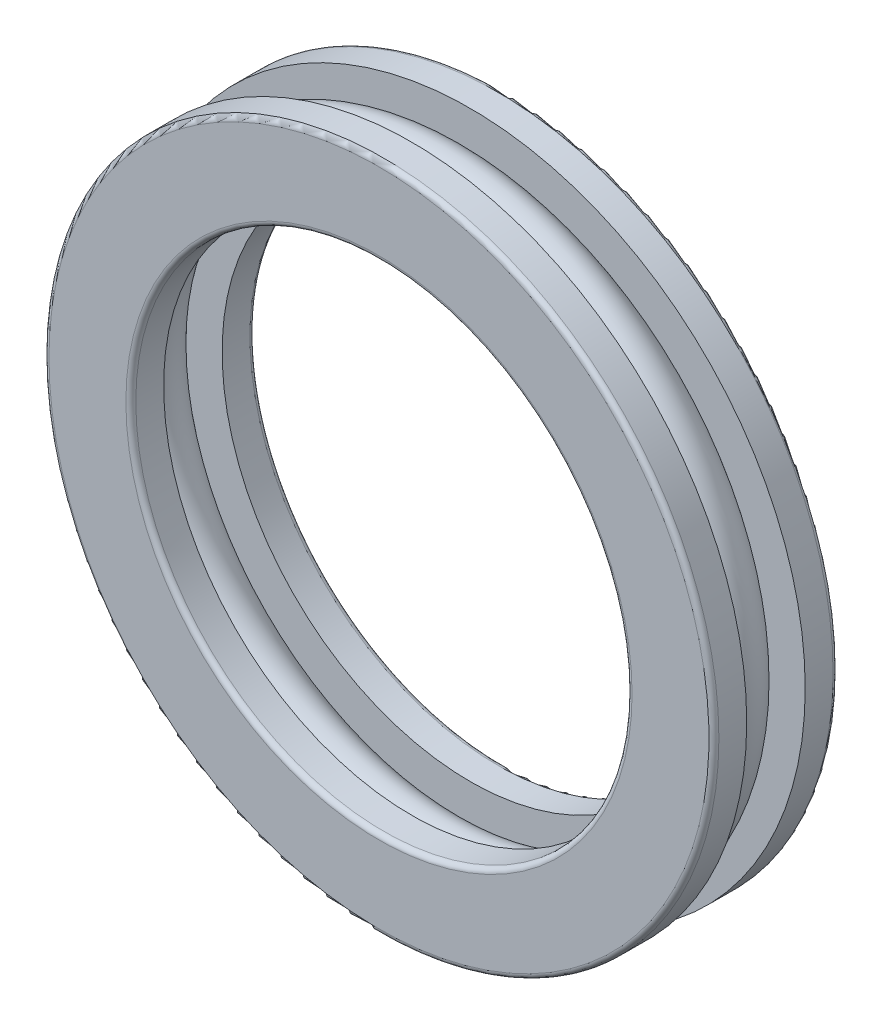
from build123d import *

# Parameters (mm, degrees)
SKETCH_1_R = 5.202601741
SKETCH_1_W = 17.5
SKETCH_1_H = 6.606566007
FILLET_1_R = 1
FILLET_2_R = 1


with BuildPart() as part:
    # Sketch 1 → Revolve 1 (revolve)
    with BuildSketch(Plane(origin=(0, 0, 0), x_dir=(1, 0, 0), z_dir=(0, 1, 0)), mode=Mode.PRIVATE) as revolve_1_sk:
        with Locations((-58.75, 12.5)):
            Circle(SKETCH_1_R)
        with Locations((-58.75, 3.303283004)):
            Rectangle(SKETCH_1_W, SKETCH_1_H)
        with Locations((-58.75, 21.696716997)):
            Rectangle(SKETCH_1_W, SKETCH_1_H)
    revolve(revolve_1_sk.sketch.rotate(Axis((0, 0, 0), (0, 0, -1)), 180), axis=Axis((0, 0, 0), (0, 0, -1)))

    # Fillet 1
    fillet_1_edges = [part.edges().sort_by_distance(p)[0] for p in [
        (-67.5, 0, 0),
        (-50, 0, 0),
    ]]
    fillet(fillet_1_edges, radius=FILLET_1_R)

    # Fillet 2
    fillet_2_edges = [part.edges().sort_by_distance(p)[0] for p in [
        (-67.5, 0, -25),
        (-50, 0, -25),
    ]]
    fillet(fillet_2_edges, radius=FILLET_2_R)


solid = part.part
